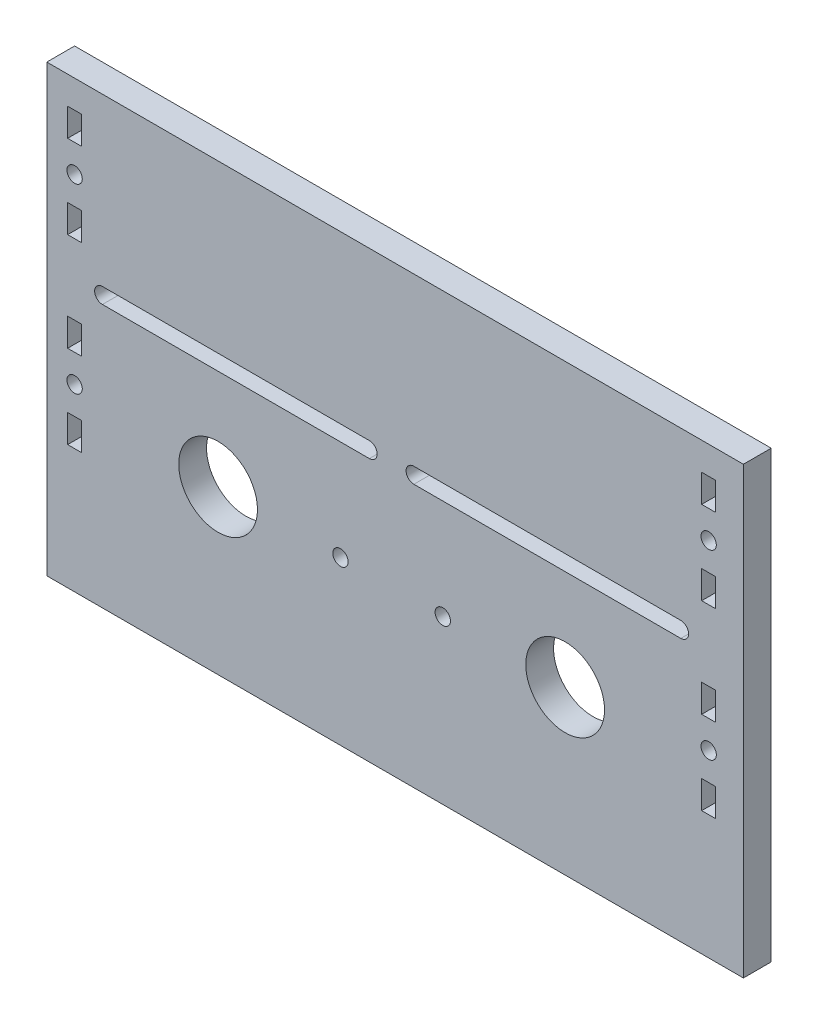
from build123d import *

# Parameters (mm, degrees)
SKETCH1_W           = 165.1
SKETCH1_H           = 101.6
BOSS_EXTRUDE1_DEPTH = 6.35
SKETCH2_R           = 1.7526
SKETCH2_R_2         = 8.9916
SKETCH2_W           = 3.175
SKETCH2_H           = 6.35
CUT_EXTRUDE2_DEPTH  = 18.796
SKETCH3_W           = 6.0325
SKETCH3_H           = 101.6
CUT_EXTRUDE3_DEPTH  = 18.542
SCALE1_SCALE        = 0.5


with BuildPart() as part:
    # Sketch1 → Boss-Extrude1 (new body)
    with BuildSketch(Plane.XY):
        with Locations((-137.715319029, -13.747931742)):
            Rectangle(SKETCH1_W, SKETCH1_H)
    extrude(amount=BOSS_EXTRUDE1_DEPTH)

    # Sketch2 → Cut-Extrude2 (cut)
    with BuildSketch(Plane.XY):
        with Locations((-213.915319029, 18.002068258)):
            Circle(SKETCH2_R)
        with Locations((-213.915319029, -23.51429349)):
            Circle(SKETCH2_R)
        with Locations((-153.209319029, -27.394112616)):
            Circle(SKETCH2_R)
        with Locations((-69.135319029, -23.51429349)):
            Circle(SKETCH2_R)
        with Locations((-69.135319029, 18.002068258)):
            Circle(SKETCH2_R)
        with Locations((-129.841319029, -27.394112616)):
            Circle(SKETCH2_R)
        with Locations((-181.149319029, -27.394112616)):
            Circle(SKETCH2_R_2)
        with Locations((-101.901319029, -27.394112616)):
            Circle(SKETCH2_R_2)
        with Locations((-213.915319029, 27.527068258)):
            Rectangle(SKETCH2_W, SKETCH2_H)
        with Locations((-213.915319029, 8.477068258)):
            Rectangle(SKETCH2_W, SKETCH2_H)
        with Locations((-213.915319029, -13.98929349)):
            Rectangle(SKETCH2_W, SKETCH2_H)
        with Locations((-213.915319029, -33.03929349)):
            Rectangle(SKETCH2_W, SKETCH2_H)
        with BuildLine():
            Line((-207.565319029, -0.978112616), (-146.605319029, -0.978112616))
            ThreePointArc((-146.605319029, -0.978112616), (-144.827319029, -2.756112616), (-146.605319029, -4.534112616))
            Line((-146.605319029, -4.534112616), (-207.565319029, -4.534112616))
            ThreePointArc((-207.565319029, -4.534112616), (-209.343319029, -2.756112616), (-207.565319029, -0.978112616))
        make_face()
        with BuildLine():
            Line((-75.485319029, -0.978112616), (-136.445319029, -0.978112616))
            ThreePointArc((-136.445319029, -0.978112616), (-138.223319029, -2.756112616), (-136.445319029, -4.534112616))
            Line((-136.445319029, -4.534112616), (-75.485319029, -4.534112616))
            ThreePointArc((-75.485319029, -4.534112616), (-73.707319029, -2.756112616), (-75.485319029, -0.978112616))
        make_face()
        with Locations((-69.135319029, 27.527068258)):
            Rectangle(SKETCH2_W, SKETCH2_H)
        with Locations((-69.135319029, -13.98929349)):
            Rectangle(SKETCH2_W, SKETCH2_H)
        with Locations((-69.135319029, 8.477068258)):
            Rectangle(SKETCH2_W, SKETCH2_H)
        with Locations((-69.135319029, -33.03929349)):
            Rectangle(SKETCH2_W, SKETCH2_H)
    extrude(amount=CUT_EXTRUDE2_DEPTH, mode=Mode.SUBTRACT)

    # Sketch3 → Cut-Extrude3 (cut)
    with BuildSketch(Plane.XY):
        with Locations((-58.181569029, -13.747931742)):
            Rectangle(SKETCH3_W, SKETCH3_H)
    extrude(amount=CUT_EXTRUDE3_DEPTH, mode=Mode.SUBTRACT)


with BuildPart() as part_1:
    # Scale1: scaled about (-140.669015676, -13.746962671, 3.175)
    add(part.part.scale(SCALE1_SCALE).moved(Location((-70.334507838, -6.873481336, 1.5875))))


solid = part_1.part
